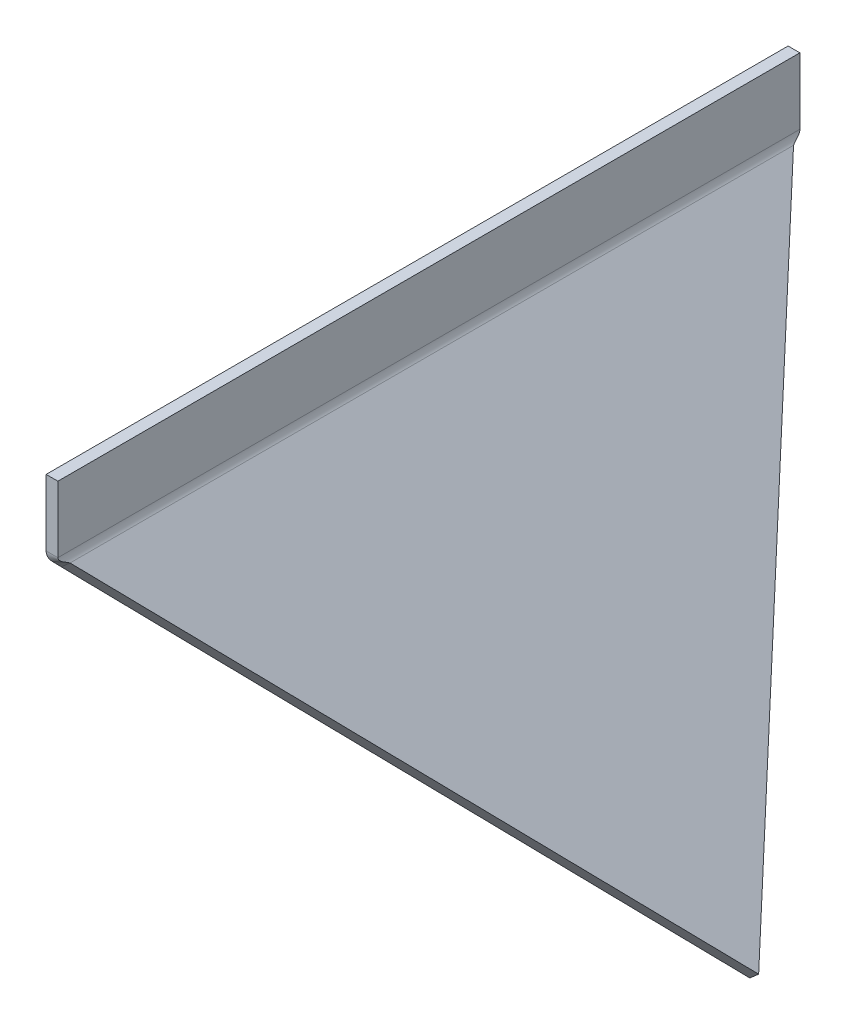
ISO-10303-21;
HEADER;
FILE_DESCRIPTION(('STEP AP214'),'2;1');
FILE_NAME('part.step','',(''),(''),'','','');
FILE_SCHEMA(('AUTOMOTIVE_DESIGN { 1 0 10303 214 1 1 1 1 }'));
ENDSEC;
DATA;
#1=APPLICATION_CONTEXT('core data for automotive mechanical design processes');
#2=APPLICATION_PROTOCOL_DEFINITION('international standard','automotive_design',2000,#1);
#3=PRODUCT_CONTEXT('',#1,'mechanical');
#4=PRODUCT('Part','Part','',(#3));
#5=PRODUCT_RELATED_PRODUCT_CATEGORY('part','',(#4));
#6=PRODUCT_DEFINITION_FORMATION('','',#4);
#7=PRODUCT_DEFINITION_CONTEXT('part definition',#1,'design');
#8=PRODUCT_DEFINITION('design','',#6,#7);
#9=PRODUCT_DEFINITION_SHAPE('','',#8);
#10=(LENGTH_UNIT() NAMED_UNIT(*) SI_UNIT(.MILLI.,.METRE.));
#11=(NAMED_UNIT(*) PLANE_ANGLE_UNIT() SI_UNIT($,.RADIAN.));
#12=(NAMED_UNIT(*) SI_UNIT($,.STERADIAN.) SOLID_ANGLE_UNIT());
#13=UNCERTAINTY_MEASURE_WITH_UNIT(LENGTH_MEASURE(1.E-05),#10,'distance_accuracy_value','');
#14=(GEOMETRIC_REPRESENTATION_CONTEXT(3) GLOBAL_UNCERTAINTY_ASSIGNED_CONTEXT((#13)) GLOBAL_UNIT_ASSIGNED_CONTEXT((#10,
#11,#12)) REPRESENTATION_CONTEXT('',''));
#15=CARTESIAN_POINT('',(0.,0.,0.));
#16=DIRECTION('',(0.,0.,1.));
#17=DIRECTION('',(1.,0.,0.));
#18=AXIS2_PLACEMENT_3D('',#15,#16,#17);
#19=CARTESIAN_POINT('',(-355.6,406.4,-1020.15040996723));
#20=DIRECTION('',(0.752576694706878,0.658504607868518,0.));
#21=DIRECTION('',(-0.658504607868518,0.752576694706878,0.));
#22=AXIS2_PLACEMENT_3D('',#19,#20,#21);
#23=PLANE('',#22);
#24=DIRECTION('',(0.,0.,1.));
#25=VECTOR('',#24,1.);
#26=CARTESIAN_POINT('',(-352.457724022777,402.808827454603,400.050000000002));
#27=LINE('',#26,#25);
#28=CARTESIAN_POINT('',(-352.457724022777,402.808827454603,-390.076344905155));
#29=VERTEX_POINT('',#28);
#30=CARTESIAN_POINT('',(-352.457724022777,402.808827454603,390.076344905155));
#31=VERTEX_POINT('',#30);
#32=EDGE_CURVE('E129',#29,#31,#27,.T.);
#33=ORIENTED_EDGE('',*,*,#32,.T.);
#34=DIRECTION('',(-0.532172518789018,0.608197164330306,0.588972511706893));
#35=VECTOR('',#34,1.);
#36=CARTESIAN_POINT('',(87.5044216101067,-100.005053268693,-96.8439691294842));
#37=LINE('',#36,#35);
#38=CARTESIAN_POINT('',(-1.11022302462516E-13,1.66533453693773E-13,0.));
#39=VERTEX_POINT('',#38);
#40=EDGE_CURVE('E117',#39,#31,#37,.T.);
#41=ORIENTED_EDGE('',*,*,#40,.F.);
#42=DIRECTION('',(0.532172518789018,-0.608197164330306,0.588972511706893));
#43=VECTOR('',#42,1.);
#44=CARTESIAN_POINT('',(-551.997235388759,630.853983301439,-610.913165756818));
#45=LINE('',#44,#43);
#46=EDGE_CURVE('E127',#29,#39,#45,.T.);
#47=ORIENTED_EDGE('',*,*,#46,.F.);
#48=EDGE_LOOP('',(#33,#41,#47));
#49=FACE_BOUND('',#48,.T.);
#50=ADVANCED_FACE('F39',(#49),#23,.T.);
#51=CARTESIAN_POINT('',(-342.9,411.171835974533,-1020.15040996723));
#52=DIRECTION('',(0.,0.,-1.));
#53=DIRECTION('',(-1.,0.,0.));
#54=AXIS2_PLACEMENT_3D('',#51,#52,#53);
#55=CYLINDRICAL_SURFACE('',#54,12.7);
#56=CARTESIAN_POINT('',(-355.6,411.171835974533,400.050000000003));
#57=CARTESIAN_POINT('',(-355.600000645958,411.112539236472,400.050002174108));
#58=CARTESIAN_POINT('',(-355.599584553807,411.053250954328,400.048684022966));
#59=CARTESIAN_POINT('',(-355.597925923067,410.934806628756,400.043412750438));
#60=CARTESIAN_POINT('',(-355.596683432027,410.875650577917,400.03945978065));
#61=CARTESIAN_POINT('',(-355.591731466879,410.698709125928,400.023671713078));
#62=CARTESIAN_POINT('',(-355.58679746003,410.581283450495,400.007907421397));
#63=CARTESIAN_POINT('',(-355.573894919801,410.349843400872,399.96654241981));
#64=CARTESIAN_POINT('',(-355.565963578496,410.235804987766,399.941062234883));
#65=CARTESIAN_POINT('',(-355.547285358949,410.010385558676,399.880892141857));
#66=CARTESIAN_POINT('',(-355.536537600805,409.899005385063,399.846199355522));
#67=CARTESIAN_POINT('',(-355.517134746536,409.721830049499,399.783486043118));
#68=CARTESIAN_POINT('',(-355.50927039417,409.655015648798,399.758049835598));
#69=CARTESIAN_POINT('',(-355.492651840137,409.522725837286,399.70415953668));
#70=CARTESIAN_POINT('',(-355.483897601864,409.457250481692,399.675705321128));
#71=CARTESIAN_POINT('',(-355.456399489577,409.262923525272,399.586139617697));
#72=CARTESIAN_POINT('',(-355.436419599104,409.136165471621,399.520823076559));
#73=CARTESIAN_POINT('',(-355.393600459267,408.888004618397,399.380381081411));
#74=CARTESIAN_POINT('',(-355.370748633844,408.766628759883,399.305212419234));
#75=CARTESIAN_POINT('',(-355.32274932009,408.529889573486,399.146618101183));
#76=CARTESIAN_POINT('',(-355.297601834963,408.414526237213,399.063192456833));
#77=CARTESIAN_POINT('',(-355.251058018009,408.213864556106,398.907711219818));
#78=CARTESIAN_POINT('',(-355.230008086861,408.127408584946,398.837034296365));
#79=CARTESIAN_POINT('',(-355.186958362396,407.95807170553,398.691783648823));
#80=CARTESIAN_POINT('',(-355.164958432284,407.875191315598,398.617209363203));
#81=CARTESIAN_POINT('',(-355.0977696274,407.631663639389,398.388250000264));
#82=CARTESIAN_POINT('',(-355.051405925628,407.476189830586,398.228675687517));
#83=CARTESIAN_POINT('',(-354.956606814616,407.177740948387,397.898317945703));
#84=CARTESIAN_POINT('',(-354.90816730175,407.034792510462,397.727511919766));
#85=CARTESIAN_POINT('',(-354.810185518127,406.76063994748,397.377165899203));
#86=CARTESIAN_POINT('',(-354.760643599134,406.629432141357,397.197628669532));
#87=CARTESIAN_POINT('',(-354.648270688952,406.345120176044,396.784066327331));
#88=CARTESIAN_POINT('',(-354.585312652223,406.195114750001,396.547945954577));
#89=CARTESIAN_POINT('',(-354.491426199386,405.981963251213,396.188059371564));
#90=CARTESIAN_POINT('',(-354.460344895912,405.913139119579,396.067635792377));
#91=CARTESIAN_POINT('',(-354.398380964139,405.778999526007,395.824810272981));
#92=CARTESIAN_POINT('',(-354.367498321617,405.713683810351,395.702408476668));
#93=CARTESIAN_POINT('',(-354.336762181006,405.650018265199,395.57911073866));
#94=B_SPLINE_CURVE_WITH_KNOTS('',3,(#56,#57,#58,#59,#60,#61,#62,#63,#64,#65,#66,#67,#68,#69,#70,
#71,#72,#73,#74,#75,#76,#77,#78,#79,#80,#81,#82,#83,#84,#85,#86,#87,#88,#89,#90,#91,#92,#93),
.UNSPECIFIED.,.F.,.F.,(4,2,2,2,2,2,2,2,2,2,2,2,2,2,2,2,2,2,4),(0.,0.177857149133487,
0.355704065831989,0.710898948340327,1.06182391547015,1.41285864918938,1.62855600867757,
1.84426224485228,2.2756569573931,2.70901123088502,3.14236489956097,3.4831360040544,
3.82395634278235,4.50582920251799,5.18911856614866,5.87219294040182,6.73171319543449,
7.15809834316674,7.58445261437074),.UNSPECIFIED.);
#95=CARTESIAN_POINT('',(-355.6,411.171835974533,400.050000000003));
#96=VERTEX_POINT('',#95);
#97=CARTESIAN_POINT('',(-354.336762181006,405.6500182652,395.57911073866));
#98=VERTEX_POINT('',#97);
#99=EDGE_CURVE('E274',#96,#98,#94,.T.);
#100=ORIENTED_EDGE('',*,*,#99,.T.);
#101=CARTESIAN_POINT('',(-342.9,411.171835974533,406.273665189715));
#102=DIRECTION('',(0.,0.888551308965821,-0.458777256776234));
#103=DIRECTION('',(0.,-0.458777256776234,-0.888551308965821));
#104=AXIS2_PLACEMENT_3D('',#101,#102,#103);
#105=ELLIPSE('',#104,27.6822789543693,12.7);
#106=EDGE_CURVE('E228',#98,#31,#105,.F.);
#107=ORIENTED_EDGE('',*,*,#106,.T.);
#108=ORIENTED_EDGE('',*,*,#32,.F.);
#109=CARTESIAN_POINT('',(-342.9,411.171835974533,-406.273665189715));
#110=DIRECTION('',(0.,0.888551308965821,0.458777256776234));
#111=DIRECTION('',(0.,0.458777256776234,-0.888551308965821));
#112=AXIS2_PLACEMENT_3D('',#109,#110,#111);
#113=ELLIPSE('',#112,27.6822789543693,12.7);
#114=CARTESIAN_POINT('',(-354.336762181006,405.650018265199,-395.57911073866));
#115=VERTEX_POINT('',#114);
#116=EDGE_CURVE('E236',#29,#115,#113,.F.);
#117=ORIENTED_EDGE('',*,*,#116,.T.);
#118=CARTESIAN_POINT('',(-354.336762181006,405.650018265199,-395.57911073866));
#119=CARTESIAN_POINT('',(-354.384770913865,405.749503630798,-395.771737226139));
#120=CARTESIAN_POINT('',(-354.433162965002,405.853000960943,-395.962256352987));
#121=CARTESIAN_POINT('',(-354.530623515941,406.069586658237,-396.339404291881));
#122=CARTESIAN_POINT('',(-354.57969437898,406.18273602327,-396.525997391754));
#123=CARTESIAN_POINT('',(-354.677878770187,406.419156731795,-396.89342208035));
#124=CARTESIAN_POINT('',(-354.726992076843,406.542453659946,-397.07423740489));
#125=CARTESIAN_POINT('',(-354.800707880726,406.736961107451,-397.341972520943));
#126=CARTESIAN_POINT('',(-354.82558327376,406.804249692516,-397.431680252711));
#127=CARTESIAN_POINT('',(-354.875063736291,406.941802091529,-397.608859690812));
#128=CARTESIAN_POINT('',(-354.899668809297,407.012065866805,-397.696331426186));
#129=CARTESIAN_POINT('',(-354.972807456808,407.227186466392,-397.954686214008));
#130=CARTESIAN_POINT('',(-355.020778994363,407.376671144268,-398.12192355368));
#131=CARTESIAN_POINT('',(-355.114119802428,407.688766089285,-398.443997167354));
#132=CARTESIAN_POINT('',(-355.15949359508,407.851352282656,-398.5988551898));
#133=CARTESIAN_POINT('',(-355.229104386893,408.123191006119,-398.834064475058));
#134=CARTESIAN_POINT('',(-355.254540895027,408.227786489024,-398.919456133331));
#135=CARTESIAN_POINT('',(-355.303717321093,408.442381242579,-399.083755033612));
#136=CARTESIAN_POINT('',(-355.327457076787,408.552381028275,-399.162661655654));
#137=CARTESIAN_POINT('',(-355.372789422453,408.777537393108,-399.312607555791));
#138=CARTESIAN_POINT('',(-355.39438865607,408.892676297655,-399.383671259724));
#139=CARTESIAN_POINT('',(-355.435092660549,409.128373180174,-399.517012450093));
#140=CARTESIAN_POINT('',(-355.4541979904,409.248929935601,-399.57929190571));
#141=CARTESIAN_POINT('',(-355.480779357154,409.434599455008,-399.66568202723));
#142=CARTESIAN_POINT('',(-355.489356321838,409.497843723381,-399.693509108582));
#143=CARTESIAN_POINT('',(-355.505681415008,409.625568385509,-399.74640201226));
#144=CARTESIAN_POINT('',(-355.513429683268,409.690048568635,-399.771468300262));
#145=CARTESIAN_POINT('',(-355.535346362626,409.88530757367,-399.842207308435));
#146=CARTESIAN_POINT('',(-355.548185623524,410.017897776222,-399.883416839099));
#147=CARTESIAN_POINT('',(-355.569802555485,410.286295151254,-399.952779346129));
#148=CARTESIAN_POINT('',(-355.578593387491,410.422090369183,-399.980974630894));
#149=CARTESIAN_POINT('',(-355.591820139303,410.695972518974,-400.023505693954));
#150=CARTESIAN_POINT('',(-355.596260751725,410.834056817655,-400.037856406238));
#151=CARTESIAN_POINT('',(-355.598956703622,411.005676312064,-400.046602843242));
#152=CARTESIAN_POINT('',(-355.599347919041,411.038905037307,-400.047875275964));
#153=CARTESIAN_POINT('',(-355.599869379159,411.105366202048,-400.049573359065));
#154=CARTESIAN_POINT('',(-355.599999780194,411.138598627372,-400.049999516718));
#155=CARTESIAN_POINT('',(-355.6,411.171835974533,-400.050000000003));
#156=B_SPLINE_CURVE_WITH_KNOTS('',3,(#118,#119,#120,#121,#122,#123,#124,#125,#126,#127,#128,
#129,#130,#131,#132,#133,#134,#135,#136,#137,#138,#139,#140,#141,#142,#143,#144,#145,#146,#147,
#148,#149,#150,#151,#152,#153,#154,#155),.UNSPECIFIED.,.F.,.F.,(4,2,2,2,2,2,2,2,2,2,2,2,2,2,2,2,
2,2,4),(0.,0.66618477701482,1.33694560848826,2.00945269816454,2.35399640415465,2.69853563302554,
3.38604626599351,4.07232122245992,4.48429451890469,4.89630715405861,5.3069980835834,
5.71759680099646,5.92641196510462,6.13519185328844,6.55277519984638,6.96899128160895,
7.38475789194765,7.48451702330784,7.58421633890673),.UNSPECIFIED.);
#157=CARTESIAN_POINT('',(-355.6,411.171835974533,-400.050000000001));
#158=VERTEX_POINT('',#157);
#159=EDGE_CURVE('E238',#115,#158,#156,.T.);
#160=ORIENTED_EDGE('',*,*,#159,.T.);
#161=DIRECTION('',(0.,0.,1.));
#162=VECTOR('',#161,1.);
#163=CARTESIAN_POINT('',(-355.6,411.171835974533,-400.05));
#164=LINE('',#163,#162);
#165=EDGE_CURVE('E157',#96,#158,#164,.F.);
#166=ORIENTED_EDGE('',*,*,#165,.F.);
#167=EDGE_LOOP('',(#100,#107,#108,#117,#160,#166));
#168=FACE_BOUND('',#167,.T.);
#169=ADVANCED_FACE('F192',(#168),#55,.F.);
#170=CARTESIAN_POINT('',(-365.157724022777,398.03699148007,-1020.15040996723));
#171=DIRECTION('',(0.752576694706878,0.658504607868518,0.));
#172=DIRECTION('',(-0.658504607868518,0.752576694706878,0.));
#173=AXIS2_PLACEMENT_3D('',#170,#171,#172);
#174=PLANE('',#173);
#175=DIRECTION('',(-0.532172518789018,0.608197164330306,0.588972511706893));
#176=VECTOR('',#175,1.);
#177=CARTESIAN_POINT('',(77.9466975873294,-108.368061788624,-96.8439691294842));
#178=LINE('',#177,#176);
#179=CARTESIAN_POINT('',(-9.55772402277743,-8.36300851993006,0.));
#180=VERTEX_POINT('',#179);
#181=CARTESIAN_POINT('',(-362.015448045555,394.445818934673,390.076344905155));
#182=VERTEX_POINT('',#181);
#183=EDGE_CURVE('E81',#180,#182,#178,.T.);
#184=ORIENTED_EDGE('',*,*,#183,.T.);
#185=DIRECTION('',(0.,0.,1.));
#186=VECTOR('',#185,1.);
#187=CARTESIAN_POINT('',(-362.015448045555,394.445818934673,-1020.15040996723));
#188=LINE('',#187,#186);
#189=CARTESIAN_POINT('',(-362.015448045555,394.445818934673,-390.076344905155));
#190=VERTEX_POINT('',#189);
#191=EDGE_CURVE('E162',#190,#182,#188,.T.);
#192=ORIENTED_EDGE('',*,*,#191,.F.);
#193=DIRECTION('',(0.532172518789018,-0.608197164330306,0.588972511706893));
#194=VECTOR('',#193,1.);
#195=CARTESIAN_POINT('',(-561.554959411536,622.490974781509,-610.913165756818));
#196=LINE('',#195,#194);
#197=EDGE_CURVE('E133',#190,#180,#196,.T.);
#198=ORIENTED_EDGE('',*,*,#197,.T.);
#199=EDGE_LOOP('',(#184,#192,#198));
#200=FACE_BOUND('',#199,.T.);
#201=ADVANCED_FACE('F197',(#200),#174,.F.);
#202=CARTESIAN_POINT('',(-342.9,411.171835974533,-1020.15040996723));
#203=DIRECTION('',(0.,0.,-1.));
#204=DIRECTION('',(-1.,0.,0.));
#205=AXIS2_PLACEMENT_3D('',#202,#203,#204);
#206=CYLINDRICAL_SURFACE('',#205,25.4);
#207=CARTESIAN_POINT('',(-342.9,411.171835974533,406.273665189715));
#208=DIRECTION('',(0.,0.695662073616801,-0.718369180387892));
#209=DIRECTION('',(0.,-0.718369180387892,-0.695662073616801));
#210=AXIS2_PLACEMENT_3D('',#207,#208,#209);
#211=ELLIPSE('',#210,35.3578643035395,25.4);
#212=CARTESIAN_POINT('',(-365.773524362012,400.128200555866,395.57911073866));
#213=VERTEX_POINT('',#212);
#214=EDGE_CURVE('E218',#213,#182,#211,.F.);
#215=ORIENTED_EDGE('',*,*,#214,.F.);
#216=CARTESIAN_POINT('',(-368.3,411.171835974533,400.050000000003));
#217=CARTESIAN_POINT('',(-368.300002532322,411.005680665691,400.050005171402));
#218=CARTESIAN_POINT('',(-368.298369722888,410.839524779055,400.047418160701));
#219=CARTESIAN_POINT('',(-368.291851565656,410.507441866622,400.037046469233));
#220=CARTESIAN_POINT('',(-368.286966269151,410.341514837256,400.029261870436));
#221=CARTESIAN_POINT('',(-368.273963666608,410.010175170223,400.008485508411));
#222=CARTESIAN_POINT('',(-368.265847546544,409.844762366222,399.995495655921));
#223=CARTESIAN_POINT('',(-368.246419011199,409.514613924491,399.964333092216));
#224=CARTESIAN_POINT('',(-368.235106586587,409.349878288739,399.946160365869));
#225=CARTESIAN_POINT('',(-368.209388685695,409.022005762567,399.904769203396));
#226=CARTESIAN_POINT('',(-368.194996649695,408.85886504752,399.881572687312));
#227=CARTESIAN_POINT('',(-368.16315115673,408.533676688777,399.830173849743));
#228=CARTESIAN_POINT('',(-368.145697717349,408.371629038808,399.801971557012));
#229=CARTESIAN_POINT('',(-368.107797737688,408.048800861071,399.740630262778));
#230=CARTESIAN_POINT('',(-368.087350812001,407.888020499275,399.707490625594));
#231=CARTESIAN_POINT('',(-368.043551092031,407.567958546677,399.636259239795));
#232=CARTESIAN_POINT('',(-368.020198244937,407.408676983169,399.598167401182));
#233=CARTESIAN_POINT('',(-367.966786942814,407.066885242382,399.510871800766));
#234=CARTESIAN_POINT('',(-367.936251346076,406.884654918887,399.460862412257));
#235=CARTESIAN_POINT('',(-367.871562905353,406.522657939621,399.354641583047));
#236=CARTESIAN_POINT('',(-367.837409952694,406.34289135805,399.298429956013));
#237=CARTESIAN_POINT('',(-367.765653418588,405.986047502,399.179939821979));
#238=CARTESIAN_POINT('',(-367.728049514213,405.80897048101,399.117660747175));
#239=CARTESIAN_POINT('',(-367.649586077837,405.457786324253,398.987084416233));
#240=CARTESIAN_POINT('',(-367.608726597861,405.28367914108,398.918787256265));
#241=CARTESIAN_POINT('',(-367.523851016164,404.938244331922,398.776156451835));
#242=CARTESIAN_POINT('',(-367.479827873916,404.766924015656,398.701809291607));
#243=CARTESIAN_POINT('',(-367.388907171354,404.427632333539,398.547469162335));
#244=CARTESIAN_POINT('',(-367.342009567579,404.259661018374,398.467476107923));
#245=CARTESIAN_POINT('',(-367.19733191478,403.761076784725,398.219226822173));
#246=CARTESIAN_POINT('',(-367.095543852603,403.435699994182,398.042661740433));
#247=CARTESIAN_POINT('',(-366.897790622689,402.844204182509,397.69454813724));
#248=CARTESIAN_POINT('',(-366.80296520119,402.576110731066,397.525679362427));
#249=CARTESIAN_POINT('',(-366.607895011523,402.051862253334,397.173188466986));
#250=CARTESIAN_POINT('',(-366.50765039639,401.7957068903,396.989566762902));
#251=CARTESIAN_POINT('',(-366.303372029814,401.29689309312,396.609089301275));
#252=CARTESIAN_POINT('',(-366.199355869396,401.054182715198,396.412292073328));
#253=CARTESIAN_POINT('',(-365.988362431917,400.581529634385,396.005465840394));
#254=CARTESIAN_POINT('',(-365.881385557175,400.351585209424,395.795438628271));
#255=CARTESIAN_POINT('',(-365.773524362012,400.128200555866,395.57911073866));
#256=B_SPLINE_CURVE_WITH_KNOTS('',3,(#216,#217,#218,#219,#220,#221,#222,#223,#224,#225,#226,
#227,#228,#229,#230,#231,#232,#233,#234,#235,#236,#237,#238,#239,#240,#241,#242,#243,#244,#245,
#246,#247,#248,#249,#250,#251,#252,#253,#254,#255),.UNSPECIFIED.,.F.,.F.,(4,2,2,2,2,2,2,2,2,2,2,
2,2,2,2,2,2,2,2,4),(0.,0.498438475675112,0.99686909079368,1.49511690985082,1.9933661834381,
2.48948376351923,2.98559849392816,3.4817771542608,3.9779648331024,4.55206536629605,
5.12618315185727,5.7003547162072,6.27451710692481,6.84999938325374,7.42549036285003,
8.57616138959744,9.56778927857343,10.559389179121,11.5468439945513,12.5341652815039),.UNSPECIFIED.);
#257=CARTESIAN_POINT('',(-368.3,411.171835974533,400.050000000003));
#258=VERTEX_POINT('',#257);
#259=EDGE_CURVE('E219',#258,#213,#256,.T.);
#260=ORIENTED_EDGE('',*,*,#259,.F.);
#261=DIRECTION('',(0.,0.,1.));
#262=VECTOR('',#261,1.);
#263=CARTESIAN_POINT('',(-368.3,411.171835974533,-1020.15040996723));
#264=LINE('',#263,#262);
#265=CARTESIAN_POINT('',(-368.3,411.171835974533,-400.050000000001));
#266=VERTEX_POINT('',#265);
#267=EDGE_CURVE('E151',#258,#266,#264,.F.);
#268=ORIENTED_EDGE('',*,*,#267,.T.);
#269=CARTESIAN_POINT('',(-365.773524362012,400.128200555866,-395.57911073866));
#270=CARTESIAN_POINT('',(-365.87530066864,400.338988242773,-395.783270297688));
#271=CARTESIAN_POINT('',(-365.976293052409,400.555616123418,-395.981812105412));
#272=CARTESIAN_POINT('',(-366.175778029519,401.000427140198,-396.36722930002));
#273=CARTESIAN_POINT('',(-366.274268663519,401.228618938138,-396.554095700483));
#274=CARTESIAN_POINT('',(-366.467684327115,401.696169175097,-396.915463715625));
#275=CARTESIAN_POINT('',(-366.562608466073,401.935530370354,-397.089962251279));
#276=CARTESIAN_POINT('',(-366.701895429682,402.303510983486,-397.342810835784));
#277=CARTESIAN_POINT('',(-366.747998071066,402.428213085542,-397.425946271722));
#278=CARTESIAN_POINT('',(-366.838908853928,402.680276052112,-397.588825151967));
#279=CARTESIAN_POINT('',(-366.883717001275,402.807636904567,-397.668568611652));
#280=CARTESIAN_POINT('',(-367.015979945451,403.193525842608,-397.902596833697));
#281=CARTESIAN_POINT('',(-367.101302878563,403.455938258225,-398.051733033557));
#282=CARTESIAN_POINT('',(-367.265245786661,403.990406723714,-398.335704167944));
#283=CARTESIAN_POINT('',(-367.34386625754,404.262462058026,-398.470540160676));
#284=CARTESIAN_POINT('',(-367.456324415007,404.678167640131,-398.661853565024));
#285=CARTESIAN_POINT('',(-367.493007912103,404.81847226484,-398.723984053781));
#286=CARTESIAN_POINT('',(-367.564339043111,405.101280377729,-398.844283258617));
#287=CARTESIAN_POINT('',(-367.598986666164,405.243783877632,-398.902451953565));
#288=CARTESIAN_POINT('',(-367.699703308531,405.674416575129,-399.070992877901));
#289=CARTESIAN_POINT('',(-367.76254686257,405.965670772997,-399.175401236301));
#290=CARTESIAN_POINT('',(-367.878805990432,406.555600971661,-399.367391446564));
#291=CARTESIAN_POINT('',(-367.932219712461,406.854278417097,-399.45496999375));
#292=CARTESIAN_POINT('',(-368.004557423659,407.306048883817,-399.573009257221));
#293=CARTESIAN_POINT('',(-368.02732058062,407.456842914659,-399.610050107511));
#294=CARTESIAN_POINT('',(-368.070248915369,407.759802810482,-399.679794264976));
#295=CARTESIAN_POINT('',(-368.090414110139,407.911968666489,-399.712497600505));
#296=CARTESIAN_POINT('',(-368.1280703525,408.217491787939,-399.773431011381));
#297=CARTESIAN_POINT('',(-368.145561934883,408.370848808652,-399.801661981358));
#298=CARTESIAN_POINT('',(-368.177811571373,408.67860652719,-399.853596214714));
#299=CARTESIAN_POINT('',(-368.192569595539,408.833007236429,-399.877299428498));
#300=CARTESIAN_POINT('',(-368.232631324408,409.297232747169,-399.941608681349));
#301=CARTESIAN_POINT('',(-368.253762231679,409.608400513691,-399.975477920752));
#302=CARTESIAN_POINT('',(-368.279418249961,410.128506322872,-400.016712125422));
#303=CARTESIAN_POINT('',(-368.287131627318,410.336909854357,-400.029149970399));
#304=CARTESIAN_POINT('',(-368.294849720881,410.649829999,-400.041632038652));
#305=CARTESIAN_POINT('',(-368.296780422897,410.754180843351,-400.044763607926));
#306=CARTESIAN_POINT('',(-368.299355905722,410.962965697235,-400.048947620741));
#307=CARTESIAN_POINT('',(-368.300000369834,411.067399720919,-400.049999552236));
#308=CARTESIAN_POINT('',(-368.3,411.171835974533,-400.050000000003));
#309=B_SPLINE_CURVE_WITH_KNOTS('',3,(#269,#270,#271,#272,#273,#274,#275,#276,#277,#278,#279,
#280,#281,#282,#283,#284,#285,#286,#287,#288,#289,#290,#291,#292,#293,#294,#295,#296,#297,#298,
#299,#300,#301,#302,#303,#304,#305,#306,#307,#308),.UNSPECIFIED.,.F.,.F.,(4,2,2,2,2,2,2,2,2,2,2,
2,2,2,2,2,2,2,2,4),(0.,0.931704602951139,1.86411771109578,2.79676213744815,3.26712019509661,
3.73747612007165,4.67789103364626,5.61823630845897,6.09147618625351,6.56471858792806,
7.51119387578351,8.45785482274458,8.92859068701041,9.3993234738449,9.86996197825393,
10.3406056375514,11.2809102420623,11.9074506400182,12.2206708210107,12.5339681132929),.UNSPECIFIED.);
#310=CARTESIAN_POINT('',(-365.773524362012,400.128200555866,-395.57911073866));
#311=VERTEX_POINT('',#310);
#312=EDGE_CURVE('E139',#311,#266,#309,.T.);
#313=ORIENTED_EDGE('',*,*,#312,.F.);
#314=CARTESIAN_POINT('',(-342.9,411.171835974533,-406.273665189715));
#315=DIRECTION('',(0.,0.695662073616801,0.718369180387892));
#316=DIRECTION('',(0.,0.718369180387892,-0.695662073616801));
#317=AXIS2_PLACEMENT_3D('',#314,#315,#316);
#318=ELLIPSE('',#317,35.3578643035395,25.4);
#319=EDGE_CURVE('E225',#190,#311,#318,.F.);
#320=ORIENTED_EDGE('',*,*,#319,.F.);
#321=ORIENTED_EDGE('',*,*,#191,.T.);
#322=EDGE_LOOP('',(#215,#260,#268,#313,#320,#321));
#323=FACE_BOUND('',#322,.T.);
#324=ADVANCED_FACE('F190',(#323),#206,.T.);
#325=CARTESIAN_POINT('',(-355.6,406.4,-400.05));
#326=DIRECTION('',(0.,0.,-1.));
#327=DIRECTION('',(0.,1.,0.));
#328=AXIS2_PLACEMENT_3D('',#325,#326,#327);
#329=PLANE('',#328);
#330=DIRECTION('',(1.,0.,0.));
#331=VECTOR('',#330,1.);
#332=CARTESIAN_POINT('',(-355.6,411.171835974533,-400.05));
#333=LINE('',#332,#331);
#334=EDGE_CURVE('E11',#266,#158,#333,.T.);
#335=ORIENTED_EDGE('',*,*,#334,.F.);
#336=DIRECTION('',(0.,1.,0.));
#337=VECTOR('',#336,1.);
#338=CARTESIAN_POINT('',(-368.3,406.4,-400.05));
#339=LINE('',#338,#337);
#340=CARTESIAN_POINT('',(-368.3,482.6,-400.05));
#341=VERTEX_POINT('',#340);
#342=EDGE_CURVE('E122',#266,#341,#339,.T.);
#343=ORIENTED_EDGE('',*,*,#342,.T.);
#344=DIRECTION('',(1.,0.,0.));
#345=VECTOR('',#344,1.);
#346=CARTESIAN_POINT('',(-355.6,482.6,-400.05));
#347=LINE('',#346,#345);
#348=CARTESIAN_POINT('',(-355.6,482.6,-400.05));
#349=VERTEX_POINT('',#348);
#350=EDGE_CURVE('E48',#341,#349,#347,.T.);
#351=ORIENTED_EDGE('',*,*,#350,.T.);
#352=DIRECTION('',(0.,1.,0.));
#353=VECTOR('',#352,1.);
#354=CARTESIAN_POINT('',(-355.6,406.4,-400.05));
#355=LINE('',#354,#353);
#356=EDGE_CURVE('E147',#158,#349,#355,.T.);
#357=ORIENTED_EDGE('',*,*,#356,.F.);
#358=EDGE_LOOP('',(#335,#343,#351,#357));
#359=FACE_BOUND('',#358,.T.);
#360=ADVANCED_FACE('F41',(#359),#329,.T.);
#361=CARTESIAN_POINT('',(-355.6,482.6,-1020.15040996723));
#362=DIRECTION('',(0.,1.,0.));
#363=DIRECTION('',(0.,0.,1.));
#364=AXIS2_PLACEMENT_3D('',#361,#362,#363);
#365=PLANE('',#364);
#366=ORIENTED_EDGE('',*,*,#350,.F.);
#367=DIRECTION('',(0.,0.,1.));
#368=VECTOR('',#367,1.);
#369=CARTESIAN_POINT('',(-368.3,482.6,-1020.15040996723));
#370=LINE('',#369,#368);
#371=CARTESIAN_POINT('',(-368.3,482.6,400.050000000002));
#372=VERTEX_POINT('',#371);
#373=EDGE_CURVE('E168',#341,#372,#370,.T.);
#374=ORIENTED_EDGE('',*,*,#373,.T.);
#375=DIRECTION('',(1.,0.,0.));
#376=VECTOR('',#375,1.);
#377=CARTESIAN_POINT('',(-355.6,482.6,400.050000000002));
#378=LINE('',#377,#376);
#379=CARTESIAN_POINT('',(-355.6,482.6,400.050000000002));
#380=VERTEX_POINT('',#379);
#381=EDGE_CURVE('E64',#372,#380,#378,.T.);
#382=ORIENTED_EDGE('',*,*,#381,.T.);
#383=DIRECTION('',(0.,0.,1.));
#384=VECTOR('',#383,1.);
#385=CARTESIAN_POINT('',(-355.6,482.6,-1020.15040996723));
#386=LINE('',#385,#384);
#387=EDGE_CURVE('E150',#349,#380,#386,.T.);
#388=ORIENTED_EDGE('',*,*,#387,.F.);
#389=EDGE_LOOP('',(#366,#374,#382,#388));
#390=FACE_BOUND('',#389,.T.);
#391=ADVANCED_FACE('F181',(#390),#365,.T.);
#392=CARTESIAN_POINT('',(-355.6,406.4,400.050000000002));
#393=DIRECTION('',(0.,0.,-1.));
#394=DIRECTION('',(0.,1.,0.));
#395=AXIS2_PLACEMENT_3D('',#392,#393,#394);
#396=PLANE('',#395);
#397=ORIENTED_EDGE('',*,*,#381,.F.);
#398=DIRECTION('',(0.,1.,0.));
#399=VECTOR('',#398,1.);
#400=CARTESIAN_POINT('',(-368.3,406.4,400.050000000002));
#401=LINE('',#400,#399);
#402=EDGE_CURVE('E165',#258,#372,#401,.T.);
#403=ORIENTED_EDGE('',*,*,#402,.F.);
#404=DIRECTION('',(1.,0.,0.));
#405=VECTOR('',#404,1.);
#406=CARTESIAN_POINT('',(-355.6,411.171835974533,400.050000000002));
#407=LINE('',#406,#405);
#408=EDGE_CURVE('E43',#258,#96,#407,.T.);
#409=ORIENTED_EDGE('',*,*,#408,.T.);
#410=DIRECTION('',(0.,1.,0.));
#411=VECTOR('',#410,1.);
#412=CARTESIAN_POINT('',(-355.6,406.4,400.050000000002));
#413=LINE('',#412,#411);
#414=EDGE_CURVE('E153',#96,#380,#413,.T.);
#415=ORIENTED_EDGE('',*,*,#414,.T.);
#416=EDGE_LOOP('',(#397,#403,#409,#415));
#417=FACE_BOUND('',#416,.T.);
#418=ADVANCED_FACE('F183',(#417),#396,.F.);
#419=CARTESIAN_POINT('',(-355.6,406.4,-1020.15040996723));
#420=DIRECTION('',(1.,0.,0.));
#421=DIRECTION('',(0.,1.,0.));
#422=AXIS2_PLACEMENT_3D('',#419,#420,#421);
#423=PLANE('',#422);
#424=ORIENTED_EDGE('',*,*,#414,.F.);
#425=ORIENTED_EDGE('',*,*,#165,.T.);
#426=ORIENTED_EDGE('',*,*,#356,.T.);
#427=ORIENTED_EDGE('',*,*,#387,.T.);
#428=EDGE_LOOP('',(#424,#425,#426,#427));
#429=FACE_BOUND('',#428,.T.);
#430=ADVANCED_FACE('F179',(#429),#423,.T.);
#431=CARTESIAN_POINT('',(-368.3,406.4,-1020.15040996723));
#432=DIRECTION('',(1.,0.,0.));
#433=DIRECTION('',(0.,1.,0.));
#434=AXIS2_PLACEMENT_3D('',#431,#432,#433);
#435=PLANE('',#434);
#436=ORIENTED_EDGE('',*,*,#402,.T.);
#437=ORIENTED_EDGE('',*,*,#373,.F.);
#438=ORIENTED_EDGE('',*,*,#342,.F.);
#439=ORIENTED_EDGE('',*,*,#267,.F.);
#440=EDGE_LOOP('',(#436,#437,#438,#439));
#441=FACE_BOUND('',#440,.T.);
#442=ADVANCED_FACE('F204',(#441),#435,.F.);
#443=CARTESIAN_POINT('',(-561.554959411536,622.490974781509,-610.913165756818));
#444=DIRECTION('',(-0.387841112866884,0.443246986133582,0.808153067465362));
#445=DIRECTION('',(0.532172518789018,-0.608197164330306,0.588972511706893));
#446=AXIS2_PLACEMENT_3D('',#443,#444,#445);
#447=PLANE('',#446);
#448=DIRECTION('',(-0.752576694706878,-0.658504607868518,0.));
#449=VECTOR('',#448,1.);
#450=CARTESIAN_POINT('',(-9.55772402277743,-8.36300851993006,0.));
#451=LINE('',#450,#449);
#452=EDGE_CURVE('E114',#180,#39,#451,.F.);
#453=ORIENTED_EDGE('',*,*,#452,.F.);
#454=ORIENTED_EDGE('',*,*,#197,.F.);
#455=DIRECTION('',(-0.752576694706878,-0.658504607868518,0.));
#456=VECTOR('',#455,1.);
#457=CARTESIAN_POINT('',(-362.015448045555,394.445818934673,-390.076344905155));
#458=LINE('',#457,#456);
#459=EDGE_CURVE('E55',#190,#29,#458,.F.);
#460=ORIENTED_EDGE('',*,*,#459,.T.);
#461=ORIENTED_EDGE('',*,*,#46,.T.);
#462=EDGE_LOOP('',(#453,#454,#460,#461));
#463=FACE_BOUND('',#462,.T.);
#464=ADVANCED_FACE('F132',(#463),#447,.F.);
#465=CARTESIAN_POINT('',(-354.222394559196,405.705236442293,-395.57911073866));
#466=CARTESIAN_POINT('',(-354.393089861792,406.058779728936,-396.270765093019));
#467=CARTESIAN_POINT('',(-354.557039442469,406.440508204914,-396.888953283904));
#468=CARTESIAN_POINT('',(-354.857926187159,407.262867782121,-397.982367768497));
#469=CARTESIAN_POINT('',(-354.996330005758,407.709247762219,-398.46211173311));
#470=CARTESIAN_POINT('',(-355.225113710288,408.641561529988,-399.239005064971));
#471=CARTESIAN_POINT('',(-355.315463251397,409.124535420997,-399.536478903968));
#472=CARTESIAN_POINT('',(-355.439634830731,410.12650080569,-399.942737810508));
#473=CARTESIAN_POINT('',(-355.473,410.649940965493,-400.050000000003));
#474=CARTESIAN_POINT('',(-355.473,411.171835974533,-400.050000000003));
#475=CARTESIAN_POINT('',(-354.336762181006,405.650018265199,-395.57911073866));
#476=CARTESIAN_POINT('',(-354.509182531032,406.007134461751,-396.27076678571));
#477=CARTESIAN_POINT('',(-354.674787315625,406.392717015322,-396.888953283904));
#478=CARTESIAN_POINT('',(-354.978713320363,407.223383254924,-397.982367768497));
#479=CARTESIAN_POINT('',(-355.118515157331,407.674272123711,-398.46211173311));
#480=CARTESIAN_POINT('',(-355.349609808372,408.616003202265,-399.239005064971));
#481=CARTESIAN_POINT('',(-355.440871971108,409.103855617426,-399.536478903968));
#482=CARTESIAN_POINT('',(-355.566297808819,410.11594186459,-399.942737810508));
#483=CARTESIAN_POINT('',(-355.6,410.644669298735,-400.050000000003));
#484=CARTESIAN_POINT('',(-355.6,411.171835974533,-400.050000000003));
#485=CARTESIAN_POINT('',(-365.773524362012,400.128200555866,-395.57911073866));
#486=CARTESIAN_POINT('',(-366.118449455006,400.842607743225,-396.270936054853));
#487=CARTESIAN_POINT('',(-366.44957463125,401.613598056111,-396.888953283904));
#488=CARTESIAN_POINT('',(-367.057426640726,403.274930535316,-397.982367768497));
#489=CARTESIAN_POINT('',(-367.337030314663,404.176708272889,-398.46211173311));
#490=CARTESIAN_POINT('',(-367.799219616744,406.060170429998,-399.239005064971));
#491=CARTESIAN_POINT('',(-367.981743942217,407.035875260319,-399.536478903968));
#492=CARTESIAN_POINT('',(-368.232595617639,409.060047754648,-399.942737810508));
#493=CARTESIAN_POINT('',(-368.3,410.117502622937,-400.050000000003));
#494=CARTESIAN_POINT('',(-368.3,411.171835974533,-400.050000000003));
#495=CARTESIAN_POINT('',(-365.889035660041,400.072430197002,-395.57911073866));
#496=CARTESIAN_POINT('',(-366.235703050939,400.790446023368,-396.270937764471));
#497=CARTESIAN_POINT('',(-366.568499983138,401.565328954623,-396.888953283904));
#498=CARTESIAN_POINT('',(-367.179421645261,403.235051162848,-397.982367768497));
#499=CARTESIAN_POINT('',(-367.460437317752,404.141382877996,-398.46211173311));
#500=CARTESIAN_POINT('',(-367.924960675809,406.034356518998,-399.239005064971));
#501=CARTESIAN_POINT('',(-368.108406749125,407.014988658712,-399.536478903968));
#502=CARTESIAN_POINT('',(-368.360525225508,409.049383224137,-399.942737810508));
#503=CARTESIAN_POINT('',(-368.42827,410.112178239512,-400.050000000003));
#504=CARTESIAN_POINT('',(-368.42827,411.171835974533,-400.050000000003));
#505=B_SPLINE_SURFACE_WITH_KNOTS('',1,3,((#465,#466,#467,#468,#469,#470,#471,#472,#473,#474),
(#475,#476,#477,#478,#479,#480,#481,#482,#483,#484),(#485,#486,#487,#488,#489,#490,#491,#492,
#493,#494),(#495,#496,#497,#498,#499,#500,#501,#502,#503,#504)),.UNSPECIFIED.,.F.,.F.,.F.,(2,1,
1,2),(4,2,2,2,4),(-0.01,0.,1.,1.0101),(0.,0.0031186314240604,0.00623726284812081,
0.00935589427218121,0.0124745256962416),.UNSPECIFIED.);
#506=DIRECTION('',(0.900532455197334,0.434788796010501,0.));
#507=VECTOR('',#506,1.);
#508=CARTESIAN_POINT('',(-360.055143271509,402.889109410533,-395.57911073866));
#509=LINE('',#508,#507);
#510=EDGE_CURVE('E136',#311,#115,#509,.T.);
#511=ORIENTED_EDGE('',*,*,#510,.F.);
#512=ORIENTED_EDGE('',*,*,#312,.T.);
#513=ORIENTED_EDGE('',*,*,#334,.T.);
#514=ORIENTED_EDGE('',*,*,#159,.F.);
#515=EDGE_LOOP('',(#511,#512,#513,#514));
#516=FACE_BOUND('',#515,.T.);
#517=ADVANCED_FACE('F245',(#516),#505,.T.);
#518=CARTESIAN_POINT('',(-342.9,436.571835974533,-430.870790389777));
#519=CARTESIAN_POINT('',(-342.9,432.338502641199,-430.870790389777));
#520=CARTESIAN_POINT('',(-342.9,428.105169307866,-430.870790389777));
#521=CARTESIAN_POINT('',(-342.9,423.871835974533,-430.870790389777));
#522=CARTESIAN_POINT('',(-292.1,436.571835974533,-430.870790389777));
#523=CARTESIAN_POINT('',(-300.566666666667,432.3385026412,-430.870790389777));
#524=CARTESIAN_POINT('',(-309.033333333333,428.105169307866,-430.870790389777));
#525=CARTESIAN_POINT('',(-317.5,423.871835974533,-430.870790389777));
#526=CARTESIAN_POINT('',(-292.1,385.771835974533,-381.676539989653));
#527=CARTESIAN_POINT('',(-300.566666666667,390.005169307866,-381.676539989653));
#528=CARTESIAN_POINT('',(-309.033333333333,394.2385026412,-381.676539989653));
#529=CARTESIAN_POINT('',(-317.5,398.471835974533,-381.676539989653));
#530=CARTESIAN_POINT('',(-342.9,385.771835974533,-381.676539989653));
#531=CARTESIAN_POINT('',(-342.9,390.005169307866,-381.676539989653));
#532=CARTESIAN_POINT('',(-342.9,394.2385026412,-381.676539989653));
#533=CARTESIAN_POINT('',(-342.9,398.471835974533,-381.676539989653));
#534=CARTESIAN_POINT('',(-393.7,385.771835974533,-381.676539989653));
#535=CARTESIAN_POINT('',(-385.233333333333,390.005169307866,-381.676539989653));
#536=CARTESIAN_POINT('',(-376.766666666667,394.2385026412,-381.676539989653));
#537=CARTESIAN_POINT('',(-368.3,398.471835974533,-381.676539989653));
#538=CARTESIAN_POINT('',(-393.7,436.571835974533,-430.870790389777));
#539=CARTESIAN_POINT('',(-385.233333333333,432.3385026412,-430.870790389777));
#540=CARTESIAN_POINT('',(-376.766666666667,428.105169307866,-430.870790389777));
#541=CARTESIAN_POINT('',(-368.3,423.871835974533,-430.870790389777));
#542=CARTESIAN_POINT('',(-342.9,436.571835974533,-430.870790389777));
#543=CARTESIAN_POINT('',(-342.9,432.338502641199,-430.870790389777));
#544=CARTESIAN_POINT('',(-342.9,428.105169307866,-430.870790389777));
#545=CARTESIAN_POINT('',(-342.9,423.871835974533,-430.870790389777));
#546=(BOUNDED_SURFACE() B_SPLINE_SURFACE(3,3,((#518,#519,#520,#521),(#522,#523,#524,#525),(#526,
#527,#528,#529),(#530,#531,#532,#533),(#534,#535,#536,#537),(#538,#539,#540,#541),(#542,#543,
#544,#545)),.UNSPECIFIED.,.T.,.F.,.F.) B_SPLINE_SURFACE_WITH_KNOTS((4,3,4),(4,4),(0.,0.5,1.),
(0.,1.),.UNSPECIFIED.) GEOMETRIC_REPRESENTATION_ITEM() RATIONAL_B_SPLINE_SURFACE(((1.,1.,1.,1.),
(0.333333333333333,0.333333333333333,0.333333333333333,0.333333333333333),(0.333333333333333,
0.333333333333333,0.333333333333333,0.333333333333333),(1.,1.,1.,1.),(0.333333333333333,
0.333333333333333,0.333333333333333,0.333333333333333),(0.333333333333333,0.333333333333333,
0.333333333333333,0.333333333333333),(1.,1.,1.,1.))) REPRESENTATION_ITEM('') SURFACE());
#547=ORIENTED_EDGE('',*,*,#319,.T.);
#548=ORIENTED_EDGE('',*,*,#510,.T.);
#549=ORIENTED_EDGE('',*,*,#116,.F.);
#550=ORIENTED_EDGE('',*,*,#459,.F.);
#551=EDGE_LOOP('',(#547,#548,#549,#550));
#552=FACE_BOUND('',#551,.T.);
#553=ADVANCED_FACE('F253',(#552),#546,.T.);
#554=CARTESIAN_POINT('',(77.9466975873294,-108.368061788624,-96.8439691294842));
#555=DIRECTION('',(-0.387841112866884,0.443246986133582,-0.808153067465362));
#556=DIRECTION('',(-0.532172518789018,0.608197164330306,0.588972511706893));
#557=AXIS2_PLACEMENT_3D('',#554,#555,#556);
#558=PLANE('',#557);
#559=DIRECTION('',(-0.752576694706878,-0.658504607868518,0.));
#560=VECTOR('',#559,1.);
#561=CARTESIAN_POINT('',(-362.015448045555,394.445818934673,390.076344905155));
#562=LINE('',#561,#560);
#563=EDGE_CURVE('E130',#182,#31,#562,.F.);
#564=ORIENTED_EDGE('',*,*,#563,.F.);
#565=ORIENTED_EDGE('',*,*,#183,.F.);
#566=ORIENTED_EDGE('',*,*,#452,.T.);
#567=ORIENTED_EDGE('',*,*,#40,.T.);
#568=EDGE_LOOP('',(#564,#565,#566,#567));
#569=FACE_BOUND('',#568,.T.);
#570=ADVANCED_FACE('F116',(#569),#558,.F.);
#571=CARTESIAN_POINT('',(-355.473,411.171835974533,400.050000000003));
#572=CARTESIAN_POINT('',(-355.473,410.650230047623,400.050000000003));
#573=CARTESIAN_POINT('',(-355.44069096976,410.139464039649,399.946149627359));
#574=CARTESIAN_POINT('',(-355.317697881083,409.138242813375,399.543832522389));
#575=CARTESIAN_POINT('',(-355.225377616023,408.643077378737,399.239863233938));
#576=CARTESIAN_POINT('',(-354.883374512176,407.248067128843,398.078618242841));
#577=CARTESIAN_POINT('',(-354.563690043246,406.412126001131,396.96203553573));
#578=CARTESIAN_POINT('',(-354.222394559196,405.705236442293,395.57911073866));
#579=CARTESIAN_POINT('',(-355.6,411.171835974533,400.050000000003));
#580=CARTESIAN_POINT('',(-355.6,410.644961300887,400.050000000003));
#581=CARTESIAN_POINT('',(-355.567364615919,410.129036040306,399.946149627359));
#582=CARTESIAN_POINT('',(-355.443129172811,409.117701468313,399.543832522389));
#583=CARTESIAN_POINT('',(-355.349876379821,408.617534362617,399.239863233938));
#584=CARTESIAN_POINT('',(-355.004418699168,407.208433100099,398.078618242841));
#585=CARTESIAN_POINT('',(-354.681507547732,406.36405320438,396.962040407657));
#586=CARTESIAN_POINT('',(-354.336762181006,405.650018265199,395.57911073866));
#587=CARTESIAN_POINT('',(-368.3,411.171835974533,400.050000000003));
#588=CARTESIAN_POINT('',(-368.3,410.118086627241,400.050000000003));
#589=CARTESIAN_POINT('',(-368.234729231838,409.08623610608,399.946149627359));
#590=CARTESIAN_POINT('',(-367.986258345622,407.063566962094,399.543832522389));
#591=CARTESIAN_POINT('',(-367.799752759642,406.063232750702,399.239863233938));
#592=CARTESIAN_POINT('',(-367.108837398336,403.245030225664,398.078618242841));
#593=CARTESIAN_POINT('',(-366.463257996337,401.556773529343,396.962527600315));
#594=CARTESIAN_POINT('',(-365.773524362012,400.128200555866,395.57911073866));
#595=CARTESIAN_POINT('',(-368.42827,411.171835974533,400.050000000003));
#596=CARTESIAN_POINT('',(-368.42827,410.112765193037,400.050000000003));
#597=CARTESIAN_POINT('',(-368.362669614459,409.075703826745,399.946149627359));
#598=CARTESIAN_POINT('',(-368.112943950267,407.042820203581,399.543832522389));
#599=CARTESIAN_POINT('',(-367.925496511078,406.037434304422,399.239863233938));
#600=CARTESIAN_POINT('',(-367.231092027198,403.204999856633,398.078618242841));
#601=CARTESIAN_POINT('',(-366.582253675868,401.508220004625,396.962532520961));
#602=CARTESIAN_POINT('',(-365.88903566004,400.072430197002,395.57911073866));
#603=B_SPLINE_SURFACE_WITH_KNOTS('',1,3,((#571,#572,#573,#574,#575,#576,#577,#578),(#579,#580,
#581,#582,#583,#584,#585,#586),(#587,#588,#589,#590,#591,#592,#593,#594),(#595,#596,#597,#598,
#599,#600,#601,#602)),.UNSPECIFIED.,.F.,.F.,.F.,(2,1,1,2),(4,2,2,4),(-0.01,0.,1.,1.0101),(0.,
0.00311162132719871,0.00622324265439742,0.0124464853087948),.UNSPECIFIED.);
#604=DIRECTION('',(0.900532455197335,0.4347887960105,0.));
#605=VECTOR('',#604,1.);
#606=CARTESIAN_POINT('',(-360.055143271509,402.889109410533,395.57911073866));
#607=LINE('',#606,#605);
#608=EDGE_CURVE('E232',#213,#98,#607,.T.);
#609=ORIENTED_EDGE('',*,*,#408,.F.);
#610=ORIENTED_EDGE('',*,*,#259,.T.);
#611=ORIENTED_EDGE('',*,*,#608,.T.);
#612=ORIENTED_EDGE('',*,*,#99,.F.);
#613=EDGE_LOOP('',(#609,#610,#611,#612));
#614=FACE_BOUND('',#613,.T.);
#615=ADVANCED_FACE('F266',(#614),#603,.T.);
#616=CARTESIAN_POINT('',(-342.9,385.771835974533,381.676539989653));
#617=CARTESIAN_POINT('',(-342.9,390.005169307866,381.676539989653));
#618=CARTESIAN_POINT('',(-342.9,394.2385026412,381.676539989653));
#619=CARTESIAN_POINT('',(-342.9,398.471835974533,381.676539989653));
#620=CARTESIAN_POINT('',(-292.1,385.771835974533,381.676539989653));
#621=CARTESIAN_POINT('',(-300.566666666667,390.005169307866,381.676539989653));
#622=CARTESIAN_POINT('',(-309.033333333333,394.2385026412,381.676539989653));
#623=CARTESIAN_POINT('',(-317.5,398.471835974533,381.676539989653));
#624=CARTESIAN_POINT('',(-292.1,436.571835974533,430.870790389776));
#625=CARTESIAN_POINT('',(-300.566666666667,432.3385026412,430.870790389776));
#626=CARTESIAN_POINT('',(-309.033333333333,428.105169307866,430.870790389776));
#627=CARTESIAN_POINT('',(-317.5,423.871835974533,430.870790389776));
#628=CARTESIAN_POINT('',(-342.9,436.571835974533,430.870790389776));
#629=CARTESIAN_POINT('',(-342.9,432.338502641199,430.870790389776));
#630=CARTESIAN_POINT('',(-342.9,428.105169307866,430.870790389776));
#631=CARTESIAN_POINT('',(-342.9,423.871835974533,430.870790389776));
#632=CARTESIAN_POINT('',(-393.7,436.571835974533,430.870790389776));
#633=CARTESIAN_POINT('',(-385.233333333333,432.3385026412,430.870790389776));
#634=CARTESIAN_POINT('',(-376.766666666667,428.105169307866,430.870790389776));
#635=CARTESIAN_POINT('',(-368.3,423.871835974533,430.870790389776));
#636=CARTESIAN_POINT('',(-393.7,385.771835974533,381.676539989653));
#637=CARTESIAN_POINT('',(-385.233333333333,390.005169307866,381.676539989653));
#638=CARTESIAN_POINT('',(-376.766666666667,394.2385026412,381.676539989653));
#639=CARTESIAN_POINT('',(-368.3,398.471835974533,381.676539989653));
#640=CARTESIAN_POINT('',(-342.9,385.771835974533,381.676539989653));
#641=CARTESIAN_POINT('',(-342.9,390.005169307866,381.676539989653));
#642=CARTESIAN_POINT('',(-342.9,394.2385026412,381.676539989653));
#643=CARTESIAN_POINT('',(-342.9,398.471835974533,381.676539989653));
#644=(BOUNDED_SURFACE() B_SPLINE_SURFACE(3,3,((#616,#617,#618,#619),(#620,#621,#622,#623),(#624,
#625,#626,#627),(#628,#629,#630,#631),(#632,#633,#634,#635),(#636,#637,#638,#639),(#640,#641,
#642,#643)),.UNSPECIFIED.,.T.,.F.,.F.) B_SPLINE_SURFACE_WITH_KNOTS((4,3,4),(4,4),(0.,0.5,1.),
(0.,1.),.UNSPECIFIED.) GEOMETRIC_REPRESENTATION_ITEM() RATIONAL_B_SPLINE_SURFACE(((1.,1.,1.,1.),
(0.333333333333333,0.333333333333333,0.333333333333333,0.333333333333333),(0.333333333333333,
0.333333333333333,0.333333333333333,0.333333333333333),(1.,1.,1.,1.),(0.333333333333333,
0.333333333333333,0.333333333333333,0.333333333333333),(0.333333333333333,0.333333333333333,
0.333333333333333,0.333333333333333),(1.,1.,1.,1.))) REPRESENTATION_ITEM('') SURFACE());
#645=ORIENTED_EDGE('',*,*,#214,.T.);
#646=ORIENTED_EDGE('',*,*,#563,.T.);
#647=ORIENTED_EDGE('',*,*,#106,.F.);
#648=ORIENTED_EDGE('',*,*,#608,.F.);
#649=EDGE_LOOP('',(#645,#646,#647,#648));
#650=FACE_BOUND('',#649,.T.);
#651=ADVANCED_FACE('F276',(#650),#644,.T.);
#652=CLOSED_SHELL('',(#50,#169,#201,#324,#360,#391,#418,#430,#442,#464,#517,#553,#570,#615,#651));
#653=MANIFOLD_SOLID_BREP('B2',#652);
#654=ADVANCED_BREP_SHAPE_REPRESENTATION('',(#18,#653),#14);
#655=SHAPE_DEFINITION_REPRESENTATION(#9,#654);
ENDSEC;
END-ISO-10303-21;
